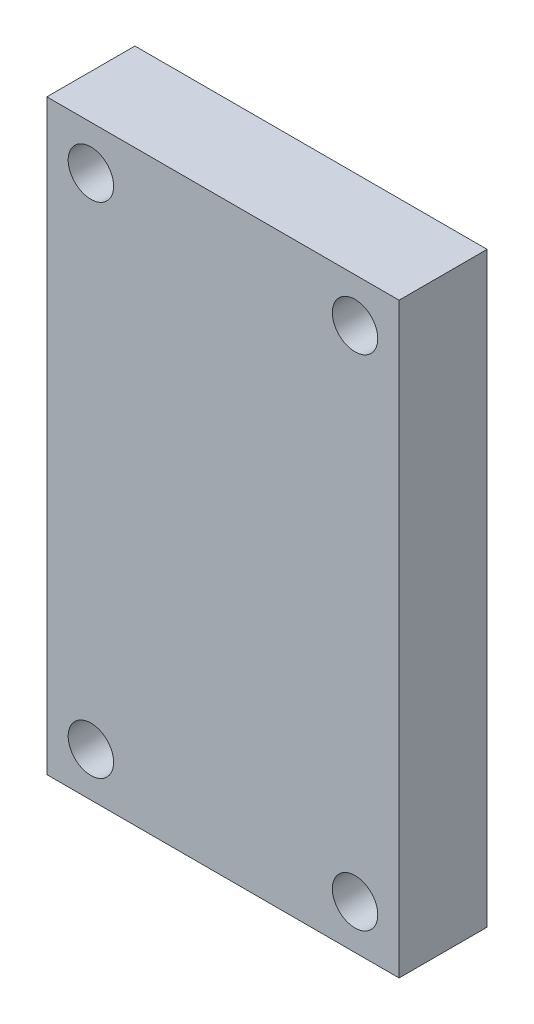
ISO-10303-21;
HEADER;
FILE_DESCRIPTION(('STEP AP214'),'2;1');
FILE_NAME('part.step','',(''),(''),'','','');
FILE_SCHEMA(('AUTOMOTIVE_DESIGN { 1 0 10303 214 1 1 1 1 }'));
ENDSEC;
DATA;
#1=APPLICATION_CONTEXT('core data for automotive mechanical design processes');
#2=APPLICATION_PROTOCOL_DEFINITION('international standard','automotive_design',2000,#1);
#3=PRODUCT_CONTEXT('',#1,'mechanical');
#4=PRODUCT('Part','Part','',(#3));
#5=PRODUCT_RELATED_PRODUCT_CATEGORY('part','',(#4));
#6=PRODUCT_DEFINITION_FORMATION('','',#4);
#7=PRODUCT_DEFINITION_CONTEXT('part definition',#1,'design');
#8=PRODUCT_DEFINITION('design','',#6,#7);
#9=PRODUCT_DEFINITION_SHAPE('','',#8);
#10=(LENGTH_UNIT() NAMED_UNIT(*) SI_UNIT(.MILLI.,.METRE.));
#11=(NAMED_UNIT(*) PLANE_ANGLE_UNIT() SI_UNIT($,.RADIAN.));
#12=(NAMED_UNIT(*) SI_UNIT($,.STERADIAN.) SOLID_ANGLE_UNIT());
#13=UNCERTAINTY_MEASURE_WITH_UNIT(LENGTH_MEASURE(1.E-05),#10,'distance_accuracy_value','');
#14=(GEOMETRIC_REPRESENTATION_CONTEXT(3) GLOBAL_UNCERTAINTY_ASSIGNED_CONTEXT((#13)) GLOBAL_UNIT_ASSIGNED_CONTEXT((#10,
#11,#12)) REPRESENTATION_CONTEXT('',''));
#15=CARTESIAN_POINT('',(0.,0.,0.));
#16=DIRECTION('',(0.,0.,1.));
#17=DIRECTION('',(1.,0.,0.));
#18=AXIS2_PLACEMENT_3D('',#15,#16,#17);
#19=CARTESIAN_POINT('',(38.1,0.,9.525));
#20=DIRECTION('',(0.,1.,0.));
#21=DIRECTION('',(-1.,0.,0.));
#22=AXIS2_PLACEMENT_3D('',#19,#20,#21);
#23=PLANE('',#22);
#24=DIRECTION('',(1.,0.,0.));
#25=VECTOR('',#24,1.);
#26=CARTESIAN_POINT('',(38.1,0.,0.));
#27=LINE('',#26,#25);
#28=CARTESIAN_POINT('',(0.,0.,0.));
#29=VERTEX_POINT('',#28);
#30=CARTESIAN_POINT('',(38.1,0.,0.));
#31=VERTEX_POINT('',#30);
#32=EDGE_CURVE('E96',#29,#31,#27,.T.);
#33=ORIENTED_EDGE('',*,*,#32,.T.);
#34=DIRECTION('',(0.,0.,-1.));
#35=VECTOR('',#34,1.);
#36=CARTESIAN_POINT('',(38.1,0.,9.525));
#37=LINE('',#36,#35);
#38=CARTESIAN_POINT('',(38.1,0.,9.525));
#39=VERTEX_POINT('',#38);
#40=EDGE_CURVE('E11',#39,#31,#37,.T.);
#41=ORIENTED_EDGE('',*,*,#40,.F.);
#42=DIRECTION('',(1.,0.,0.));
#43=VECTOR('',#42,1.);
#44=CARTESIAN_POINT('',(38.1,0.,9.525));
#45=LINE('',#44,#43);
#46=CARTESIAN_POINT('',(0.,0.,9.525));
#47=VERTEX_POINT('',#46);
#48=EDGE_CURVE('E84',#47,#39,#45,.T.);
#49=ORIENTED_EDGE('',*,*,#48,.F.);
#50=DIRECTION('',(0.,0.,-1.));
#51=VECTOR('',#50,1.);
#52=CARTESIAN_POINT('',(0.,0.,9.525));
#53=LINE('',#52,#51);
#54=EDGE_CURVE('E92',#47,#29,#53,.T.);
#55=ORIENTED_EDGE('',*,*,#54,.T.);
#56=EDGE_LOOP('',(#33,#41,#49,#55));
#57=FACE_BOUND('',#56,.T.);
#58=ADVANCED_FACE('F33',(#57),#23,.F.);
#59=CARTESIAN_POINT('',(38.1,63.5,9.525));
#60=DIRECTION('',(-1.,0.,0.));
#61=DIRECTION('',(0.,-1.,0.));
#62=AXIS2_PLACEMENT_3D('',#59,#60,#61);
#63=PLANE('',#62);
#64=DIRECTION('',(0.,1.,0.));
#65=VECTOR('',#64,1.);
#66=CARTESIAN_POINT('',(38.1,63.5,0.));
#67=LINE('',#66,#65);
#68=CARTESIAN_POINT('',(38.1,63.5,0.));
#69=VERTEX_POINT('',#68);
#70=EDGE_CURVE('E88',#31,#69,#67,.T.);
#71=ORIENTED_EDGE('',*,*,#70,.T.);
#72=DIRECTION('',(0.,0.,-1.));
#73=VECTOR('',#72,1.);
#74=CARTESIAN_POINT('',(38.1,63.5,9.525));
#75=LINE('',#74,#73);
#76=CARTESIAN_POINT('',(38.1,63.5,9.525));
#77=VERTEX_POINT('',#76);
#78=EDGE_CURVE('E41',#77,#69,#75,.T.);
#79=ORIENTED_EDGE('',*,*,#78,.F.);
#80=DIRECTION('',(0.,1.,0.));
#81=VECTOR('',#80,1.);
#82=CARTESIAN_POINT('',(38.1,63.5,9.525));
#83=LINE('',#82,#81);
#84=EDGE_CURVE('E79',#39,#77,#83,.T.);
#85=ORIENTED_EDGE('',*,*,#84,.F.);
#86=ORIENTED_EDGE('',*,*,#40,.T.);
#87=EDGE_LOOP('',(#71,#79,#85,#86));
#88=FACE_BOUND('',#87,.T.);
#89=ADVANCED_FACE('F87',(#88),#63,.F.);
#90=CARTESIAN_POINT('',(0.,63.5,9.525));
#91=DIRECTION('',(0.,-1.,0.));
#92=DIRECTION('',(0.,0.,-1.));
#93=AXIS2_PLACEMENT_3D('',#90,#91,#92);
#94=PLANE('',#93);
#95=DIRECTION('',(-1.,0.,0.));
#96=VECTOR('',#95,1.);
#97=CARTESIAN_POINT('',(0.,63.5,0.));
#98=LINE('',#97,#96);
#99=CARTESIAN_POINT('',(0.,63.5,0.));
#100=VERTEX_POINT('',#99);
#101=EDGE_CURVE('E66',#69,#100,#98,.T.);
#102=ORIENTED_EDGE('',*,*,#101,.T.);
#103=DIRECTION('',(0.,0.,-1.));
#104=VECTOR('',#103,1.);
#105=CARTESIAN_POINT('',(0.,63.5,9.525));
#106=LINE('',#105,#104);
#107=CARTESIAN_POINT('',(0.,63.5,9.525));
#108=VERTEX_POINT('',#107);
#109=EDGE_CURVE('E89',#108,#100,#106,.T.);
#110=ORIENTED_EDGE('',*,*,#109,.F.);
#111=DIRECTION('',(-1.,0.,0.));
#112=VECTOR('',#111,1.);
#113=CARTESIAN_POINT('',(0.,63.5,9.525));
#114=LINE('',#113,#112);
#115=EDGE_CURVE('E82',#77,#108,#114,.T.);
#116=ORIENTED_EDGE('',*,*,#115,.F.);
#117=ORIENTED_EDGE('',*,*,#78,.T.);
#118=EDGE_LOOP('',(#102,#110,#116,#117));
#119=FACE_BOUND('',#118,.T.);
#120=ADVANCED_FACE('F90',(#119),#94,.F.);
#121=CARTESIAN_POINT('',(0.,0.,9.525));
#122=DIRECTION('',(1.,0.,0.));
#123=DIRECTION('',(0.,0.,-1.));
#124=AXIS2_PLACEMENT_3D('',#121,#122,#123);
#125=PLANE('',#124);
#126=DIRECTION('',(0.,-1.,0.));
#127=VECTOR('',#126,1.);
#128=CARTESIAN_POINT('',(0.,0.,0.));
#129=LINE('',#128,#127);
#130=EDGE_CURVE('E72',#100,#29,#129,.T.);
#131=ORIENTED_EDGE('',*,*,#130,.T.);
#132=ORIENTED_EDGE('',*,*,#54,.F.);
#133=DIRECTION('',(0.,-1.,0.));
#134=VECTOR('',#133,1.);
#135=CARTESIAN_POINT('',(0.,0.,9.525));
#136=LINE('',#135,#134);
#137=EDGE_CURVE('E49',#108,#47,#136,.T.);
#138=ORIENTED_EDGE('',*,*,#137,.F.);
#139=ORIENTED_EDGE('',*,*,#109,.T.);
#140=EDGE_LOOP('',(#131,#132,#138,#139));
#141=FACE_BOUND('',#140,.T.);
#142=ADVANCED_FACE('F104',(#141),#125,.F.);
#143=CARTESIAN_POINT('',(0.,0.,9.525));
#144=DIRECTION('',(0.,0.,-1.));
#145=DIRECTION('',(-1.,0.,0.));
#146=AXIS2_PLACEMENT_3D('',#143,#144,#145);
#147=PLANE('',#146);
#148=CARTESIAN_POINT('',(4.7625,58.7375,9.525));
#149=DIRECTION('',(0.,0.,1.));
#150=DIRECTION('',(1.,0.,0.));
#151=AXIS2_PLACEMENT_3D('',#148,#149,#150);
#152=CIRCLE('',#151,2.45744999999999);
#153=CARTESIAN_POINT('',(7.21994999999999,58.7375,9.525));
#154=VERTEX_POINT('',#153);
#155=EDGE_CURVE('E130',#154,#154,#152,.T.);
#156=ORIENTED_EDGE('',*,*,#155,.F.);
#157=EDGE_LOOP('',(#156));
#158=FACE_BOUND('',#157,.T.);
#159=CARTESIAN_POINT('',(33.3375,58.7375,9.525));
#160=DIRECTION('',(0.,0.,1.));
#161=DIRECTION('',(1.,0.,0.));
#162=AXIS2_PLACEMENT_3D('',#159,#160,#161);
#163=CIRCLE('',#162,2.45744999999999);
#164=CARTESIAN_POINT('',(35.79495,58.7375,9.525));
#165=VERTEX_POINT('',#164);
#166=EDGE_CURVE('E124',#165,#165,#163,.T.);
#167=ORIENTED_EDGE('',*,*,#166,.F.);
#168=EDGE_LOOP('',(#167));
#169=FACE_BOUND('',#168,.T.);
#170=CARTESIAN_POINT('',(4.76250000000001,4.76250000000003,9.525));
#171=DIRECTION('',(0.,0.,1.));
#172=DIRECTION('',(1.,0.,0.));
#173=AXIS2_PLACEMENT_3D('',#170,#171,#172);
#174=CIRCLE('',#173,2.45744999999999);
#175=CARTESIAN_POINT('',(7.21995,4.76250000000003,9.525));
#176=VERTEX_POINT('',#175);
#177=EDGE_CURVE('E118',#176,#176,#174,.T.);
#178=ORIENTED_EDGE('',*,*,#177,.F.);
#179=EDGE_LOOP('',(#178));
#180=FACE_BOUND('',#179,.T.);
#181=CARTESIAN_POINT('',(33.3375,4.76249999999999,9.525));
#182=DIRECTION('',(0.,0.,1.));
#183=DIRECTION('',(1.,0.,0.));
#184=AXIS2_PLACEMENT_3D('',#181,#182,#183);
#185=CIRCLE('',#184,2.45744999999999);
#186=CARTESIAN_POINT('',(35.79495,4.76249999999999,9.525));
#187=VERTEX_POINT('',#186);
#188=EDGE_CURVE('E112',#187,#187,#185,.T.);
#189=ORIENTED_EDGE('',*,*,#188,.F.);
#190=EDGE_LOOP('',(#189));
#191=FACE_BOUND('',#190,.T.);
#192=ORIENTED_EDGE('',*,*,#48,.T.);
#193=ORIENTED_EDGE('',*,*,#84,.T.);
#194=ORIENTED_EDGE('',*,*,#115,.T.);
#195=ORIENTED_EDGE('',*,*,#137,.T.);
#196=EDGE_LOOP('',(#192,#193,#194,#195));
#197=FACE_BOUND('',#196,.T.);
#198=ADVANCED_FACE('F80',(#158,#169,#180,#191,#197),#147,.F.);
#199=CARTESIAN_POINT('',(0.,0.,0.));
#200=DIRECTION('',(0.,0.,-1.));
#201=DIRECTION('',(-1.,0.,0.));
#202=AXIS2_PLACEMENT_3D('',#199,#200,#201);
#203=PLANE('',#202);
#204=CARTESIAN_POINT('',(4.7625,58.7375,0.));
#205=DIRECTION('',(0.,0.,1.));
#206=DIRECTION('',(1.,0.,0.));
#207=AXIS2_PLACEMENT_3D('',#204,#205,#206);
#208=CIRCLE('',#207,2.45745);
#209=CARTESIAN_POINT('',(7.21995,58.7375,0.));
#210=VERTEX_POINT('',#209);
#211=EDGE_CURVE('E127',#210,#210,#208,.T.);
#212=ORIENTED_EDGE('',*,*,#211,.T.);
#213=EDGE_LOOP('',(#212));
#214=FACE_BOUND('',#213,.T.);
#215=CARTESIAN_POINT('',(33.3375,58.7375,0.));
#216=DIRECTION('',(0.,0.,1.));
#217=DIRECTION('',(1.,0.,0.));
#218=AXIS2_PLACEMENT_3D('',#215,#216,#217);
#219=CIRCLE('',#218,2.45745);
#220=CARTESIAN_POINT('',(35.79495,58.7375,0.));
#221=VERTEX_POINT('',#220);
#222=EDGE_CURVE('E121',#221,#221,#219,.T.);
#223=ORIENTED_EDGE('',*,*,#222,.T.);
#224=EDGE_LOOP('',(#223));
#225=FACE_BOUND('',#224,.T.);
#226=CARTESIAN_POINT('',(4.76250000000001,4.76250000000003,0.));
#227=DIRECTION('',(0.,0.,1.));
#228=DIRECTION('',(1.,0.,0.));
#229=AXIS2_PLACEMENT_3D('',#226,#227,#228);
#230=CIRCLE('',#229,2.45745);
#231=CARTESIAN_POINT('',(7.21995000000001,4.76250000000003,0.));
#232=VERTEX_POINT('',#231);
#233=EDGE_CURVE('E115',#232,#232,#230,.T.);
#234=ORIENTED_EDGE('',*,*,#233,.T.);
#235=EDGE_LOOP('',(#234));
#236=FACE_BOUND('',#235,.T.);
#237=CARTESIAN_POINT('',(33.3375,4.76249999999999,0.));
#238=DIRECTION('',(0.,0.,1.));
#239=DIRECTION('',(1.,0.,0.));
#240=AXIS2_PLACEMENT_3D('',#237,#238,#239);
#241=CIRCLE('',#240,2.45745);
#242=CARTESIAN_POINT('',(35.79495,4.76249999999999,0.));
#243=VERTEX_POINT('',#242);
#244=EDGE_CURVE('E99',#243,#243,#241,.T.);
#245=ORIENTED_EDGE('',*,*,#244,.T.);
#246=EDGE_LOOP('',(#245));
#247=FACE_BOUND('',#246,.T.);
#248=ORIENTED_EDGE('',*,*,#32,.F.);
#249=ORIENTED_EDGE('',*,*,#130,.F.);
#250=ORIENTED_EDGE('',*,*,#101,.F.);
#251=ORIENTED_EDGE('',*,*,#70,.F.);
#252=EDGE_LOOP('',(#248,#249,#250,#251));
#253=FACE_BOUND('',#252,.T.);
#254=ADVANCED_FACE('F107',(#214,#225,#236,#247,#253),#203,.T.);
#255=CARTESIAN_POINT('',(33.3375,4.76249999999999,9.525));
#256=DIRECTION('',(0.,0.,1.));
#257=DIRECTION('',(1.,0.,0.));
#258=AXIS2_PLACEMENT_3D('',#255,#256,#257);
#259=CYLINDRICAL_SURFACE('',#258,2.45744999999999);
#260=ORIENTED_EDGE('',*,*,#244,.F.);
#261=EDGE_LOOP('',(#260));
#262=FACE_BOUND('',#261,.T.);
#263=ORIENTED_EDGE('',*,*,#188,.T.);
#264=EDGE_LOOP('',(#263));
#265=FACE_BOUND('',#264,.T.);
#266=ADVANCED_FACE('F145',(#262,#265),#259,.F.);
#267=CARTESIAN_POINT('',(4.76250000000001,4.76250000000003,9.525));
#268=DIRECTION('',(0.,0.,1.));
#269=DIRECTION('',(1.,0.,0.));
#270=AXIS2_PLACEMENT_3D('',#267,#268,#269);
#271=CYLINDRICAL_SURFACE('',#270,2.45744999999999);
#272=ORIENTED_EDGE('',*,*,#233,.F.);
#273=EDGE_LOOP('',(#272));
#274=FACE_BOUND('',#273,.T.);
#275=ORIENTED_EDGE('',*,*,#177,.T.);
#276=EDGE_LOOP('',(#275));
#277=FACE_BOUND('',#276,.T.);
#278=ADVANCED_FACE('F147',(#274,#277),#271,.F.);
#279=CARTESIAN_POINT('',(33.3375,58.7375,9.525));
#280=DIRECTION('',(0.,0.,1.));
#281=DIRECTION('',(1.,0.,0.));
#282=AXIS2_PLACEMENT_3D('',#279,#280,#281);
#283=CYLINDRICAL_SURFACE('',#282,2.45744999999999);
#284=ORIENTED_EDGE('',*,*,#222,.F.);
#285=EDGE_LOOP('',(#284));
#286=FACE_BOUND('',#285,.T.);
#287=ORIENTED_EDGE('',*,*,#166,.T.);
#288=EDGE_LOOP('',(#287));
#289=FACE_BOUND('',#288,.T.);
#290=ADVANCED_FACE('F154',(#286,#289),#283,.F.);
#291=CARTESIAN_POINT('',(4.7625,58.7375,9.525));
#292=DIRECTION('',(0.,0.,1.));
#293=DIRECTION('',(1.,0.,0.));
#294=AXIS2_PLACEMENT_3D('',#291,#292,#293);
#295=CYLINDRICAL_SURFACE('',#294,2.45744999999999);
#296=ORIENTED_EDGE('',*,*,#211,.F.);
#297=EDGE_LOOP('',(#296));
#298=FACE_BOUND('',#297,.T.);
#299=ORIENTED_EDGE('',*,*,#155,.T.);
#300=EDGE_LOOP('',(#299));
#301=FACE_BOUND('',#300,.T.);
#302=ADVANCED_FACE('F134',(#298,#301),#295,.F.);
#303=CLOSED_SHELL('',(#58,#89,#120,#142,#198,#254,#266,#278,#290,#302));
#304=MANIFOLD_SOLID_BREP('B2',#303);
#305=ADVANCED_BREP_SHAPE_REPRESENTATION('',(#18,#304),#14);
#306=SHAPE_DEFINITION_REPRESENTATION(#9,#305);
ENDSEC;
END-ISO-10303-21;
